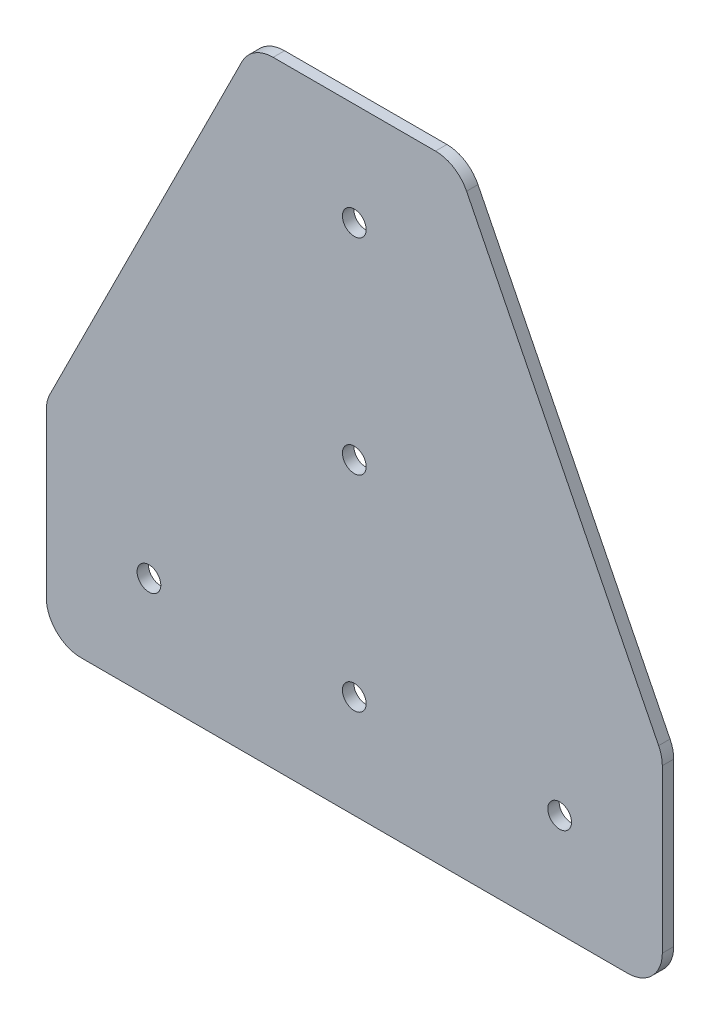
ISO-10303-21;
HEADER;
FILE_DESCRIPTION(('STEP AP214'),'2;1');
FILE_NAME('part.step','',(''),(''),'','','');
FILE_SCHEMA(('AUTOMOTIVE_DESIGN { 1 0 10303 214 1 1 1 1 }'));
ENDSEC;
DATA;
#1=APPLICATION_CONTEXT('core data for automotive mechanical design processes');
#2=APPLICATION_PROTOCOL_DEFINITION('international standard','automotive_design',2000,#1);
#3=PRODUCT_CONTEXT('',#1,'mechanical');
#4=PRODUCT('Part','Part','',(#3));
#5=PRODUCT_RELATED_PRODUCT_CATEGORY('part','',(#4));
#6=PRODUCT_DEFINITION_FORMATION('','',#4);
#7=PRODUCT_DEFINITION_CONTEXT('part definition',#1,'design');
#8=PRODUCT_DEFINITION('design','',#6,#7);
#9=PRODUCT_DEFINITION_SHAPE('','',#8);
#10=(LENGTH_UNIT() NAMED_UNIT(*) SI_UNIT(.MILLI.,.METRE.));
#11=(NAMED_UNIT(*) PLANE_ANGLE_UNIT() SI_UNIT($,.RADIAN.));
#12=(NAMED_UNIT(*) SI_UNIT($,.STERADIAN.) SOLID_ANGLE_UNIT());
#13=UNCERTAINTY_MEASURE_WITH_UNIT(LENGTH_MEASURE(1.E-05),#10,'distance_accuracy_value','');
#14=(GEOMETRIC_REPRESENTATION_CONTEXT(3) GLOBAL_UNCERTAINTY_ASSIGNED_CONTEXT((#13)) GLOBAL_UNIT_ASSIGNED_CONTEXT((#10,
#11,#12)) REPRESENTATION_CONTEXT('',''));
#15=CARTESIAN_POINT('',(0.,0.,0.));
#16=DIRECTION('',(0.,0.,1.));
#17=DIRECTION('',(1.,0.,0.));
#18=AXIS2_PLACEMENT_3D('',#15,#16,#17);
#19=CARTESIAN_POINT('',(-38.020625,0.,0.));
#20=DIRECTION('',(0.,1.,0.));
#21=DIRECTION('',(0.,0.,1.));
#22=AXIS2_PLACEMENT_3D('',#19,#20,#21);
#23=PLANE('',#22);
#24=DIRECTION('',(0.,0.,-1.));
#25=VECTOR('',#24,1.);
#26=CARTESIAN_POINT('',(38.0206250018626,0.,0.79375));
#27=LINE('',#26,#25);
#28=CARTESIAN_POINT('',(38.0206250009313,0.,0.));
#29=VERTEX_POINT('',#28);
#30=CARTESIAN_POINT('',(38.0206250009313,0.,1.5875));
#31=VERTEX_POINT('',#30);
#32=EDGE_CURVE('E160',#29,#31,#27,.F.);
#33=ORIENTED_EDGE('',*,*,#32,.T.);
#34=DIRECTION('',(1.,0.,0.));
#35=VECTOR('',#34,1.);
#36=CARTESIAN_POINT('',(0.,0.,1.5875));
#37=LINE('',#36,#35);
#38=CARTESIAN_POINT('',(-38.0206249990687,0.,1.5875));
#39=VERTEX_POINT('',#38);
#40=EDGE_CURVE('E194',#39,#31,#37,.T.);
#41=ORIENTED_EDGE('',*,*,#40,.F.);
#42=DIRECTION('',(0.,0.,1.));
#43=VECTOR('',#42,1.);
#44=CARTESIAN_POINT('',(-38.0206249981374,0.,0.79375));
#45=LINE('',#44,#43);
#46=CARTESIAN_POINT('',(-38.0206249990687,0.,0.));
#47=VERTEX_POINT('',#46);
#48=EDGE_CURVE('E130',#39,#47,#45,.F.);
#49=ORIENTED_EDGE('',*,*,#48,.T.);
#50=DIRECTION('',(1.,0.,0.));
#51=VECTOR('',#50,1.);
#52=CARTESIAN_POINT('',(0.,0.,0.));
#53=LINE('',#52,#51);
#54=EDGE_CURVE('E211',#47,#29,#53,.T.);
#55=ORIENTED_EDGE('',*,*,#54,.T.);
#56=EDGE_LOOP('',(#33,#41,#49,#55));
#57=FACE_BOUND('',#56,.T.);
#58=ADVANCED_FACE('F16',(#57),#23,.F.);
#59=CARTESIAN_POINT('',(38.020625,4.841875,1.5875));
#60=DIRECTION('',(0.,0.,-1.));
#61=DIRECTION('',(0.,1.,0.));
#62=AXIS2_PLACEMENT_3D('',#59,#60,#61);
#63=CYLINDRICAL_SURFACE('',#62,4.841875);
#64=ORIENTED_EDGE('',*,*,#32,.F.);
#65=CARTESIAN_POINT('',(38.020625,4.841875,0.));
#66=DIRECTION('',(0.,0.,-1.));
#67=DIRECTION('',(0.,1.,0.));
#68=AXIS2_PLACEMENT_3D('',#65,#66,#67);
#69=CIRCLE('',#68,4.841875);
#70=CARTESIAN_POINT('',(42.8625,4.841875,0.));
#71=VERTEX_POINT('',#70);
#72=EDGE_CURVE('E208',#29,#71,#69,.F.);
#73=ORIENTED_EDGE('',*,*,#72,.T.);
#74=DIRECTION('',(0.,0.,1.));
#75=VECTOR('',#74,1.);
#76=CARTESIAN_POINT('',(42.8625,4.841875,0.79375));
#77=LINE('',#76,#75);
#78=CARTESIAN_POINT('',(42.8625,4.841875,1.5875));
#79=VERTEX_POINT('',#78);
#80=EDGE_CURVE('E157',#71,#79,#77,.T.);
#81=ORIENTED_EDGE('',*,*,#80,.T.);
#82=CARTESIAN_POINT('',(38.020625,4.841875,1.5875));
#83=DIRECTION('',(0.,0.,-1.));
#84=DIRECTION('',(0.,1.,0.));
#85=AXIS2_PLACEMENT_3D('',#82,#83,#84);
#86=CIRCLE('',#85,4.841875);
#87=EDGE_CURVE('E192',#31,#79,#86,.F.);
#88=ORIENTED_EDGE('',*,*,#87,.F.);
#89=EDGE_LOOP('',(#64,#73,#81,#88));
#90=FACE_BOUND('',#89,.T.);
#91=ADVANCED_FACE('F301',(#90),#63,.T.);
#92=CARTESIAN_POINT('',(42.8625,4.841875,0.));
#93=DIRECTION('',(-1.,0.,0.));
#94=DIRECTION('',(0.,0.,1.));
#95=AXIS2_PLACEMENT_3D('',#92,#93,#94);
#96=PLANE('',#95);
#97=ORIENTED_EDGE('',*,*,#80,.F.);
#98=DIRECTION('',(0.,1.,0.));
#99=VECTOR('',#98,1.);
#100=CARTESIAN_POINT('',(42.8625,42.8625,0.));
#101=LINE('',#100,#99);
#102=CARTESIAN_POINT('',(42.8625,27.4319883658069,0.));
#103=VERTEX_POINT('',#102);
#104=EDGE_CURVE('E207',#71,#103,#101,.T.);
#105=ORIENTED_EDGE('',*,*,#104,.T.);
#106=DIRECTION('',(0.,0.,-1.));
#107=VECTOR('',#106,1.);
#108=CARTESIAN_POINT('',(42.8625,27.4319883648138,0.79375));
#109=LINE('',#108,#107);
#110=CARTESIAN_POINT('',(42.8625,27.4319883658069,1.5875));
#111=VERTEX_POINT('',#110);
#112=EDGE_CURVE('E104',#103,#111,#109,.F.);
#113=ORIENTED_EDGE('',*,*,#112,.T.);
#114=DIRECTION('',(0.,1.,0.));
#115=VECTOR('',#114,1.);
#116=CARTESIAN_POINT('',(42.8625,42.8625,1.5875));
#117=LINE('',#116,#115);
#118=EDGE_CURVE('E191',#79,#111,#117,.T.);
#119=ORIENTED_EDGE('',*,*,#118,.F.);
#120=EDGE_LOOP('',(#97,#105,#113,#119));
#121=FACE_BOUND('',#120,.T.);
#122=ADVANCED_FACE('F300',(#121),#96,.F.);
#123=CARTESIAN_POINT('',(38.020625,27.4319883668,1.5875));
#124=DIRECTION('',(0.,0.,-1.));
#125=DIRECTION('',(0.,1.,0.));
#126=AXIS2_PLACEMENT_3D('',#123,#124,#125);
#127=CYLINDRICAL_SURFACE('',#126,4.841875);
#128=ORIENTED_EDGE('',*,*,#112,.F.);
#129=CARTESIAN_POINT('',(38.020625,27.4319883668,0.));
#130=DIRECTION('',(0.,0.,-1.));
#131=DIRECTION('',(0.,1.,0.));
#132=AXIS2_PLACEMENT_3D('',#129,#130,#131);
#133=CIRCLE('',#132,4.841875);
#134=CARTESIAN_POINT('',(42.3513296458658,29.5973406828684,0.));
#135=VERTEX_POINT('',#134);
#136=EDGE_CURVE('E20',#103,#135,#133,.F.);
#137=ORIENTED_EDGE('',*,*,#136,.T.);
#138=DIRECTION('',(0.,0.,1.));
#139=VECTOR('',#138,1.);
#140=CARTESIAN_POINT('',(42.3513296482,29.5973406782,0.79375));
#141=LINE('',#140,#139);
#142=CARTESIAN_POINT('',(42.351329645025,29.5973406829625,1.5875));
#143=VERTEX_POINT('',#142);
#144=EDGE_CURVE('E111',#135,#143,#141,.T.);
#145=ORIENTED_EDGE('',*,*,#144,.T.);
#146=CARTESIAN_POINT('',(38.020625,27.4319883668,1.5875));
#147=DIRECTION('',(0.,0.,-1.));
#148=DIRECTION('',(0.,1.,0.));
#149=AXIS2_PLACEMENT_3D('',#146,#147,#148);
#150=CIRCLE('',#149,4.841875);
#151=EDGE_CURVE('E189',#111,#143,#150,.F.);
#152=ORIENTED_EDGE('',*,*,#151,.F.);
#153=EDGE_LOOP('',(#128,#137,#145,#152));
#154=FACE_BOUND('',#153,.T.);
#155=ADVANCED_FACE('F128',(#154),#127,.T.);
#156=CARTESIAN_POINT('',(15.6257613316,83.0484773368,0.));
#157=DIRECTION('',(-0.894427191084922,-0.447213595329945,0.));
#158=DIRECTION('',(0.447213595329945,-0.894427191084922,0.));
#159=AXIS2_PLACEMENT_3D('',#156,#157,#158);
#160=PLANE('',#159);
#161=ORIENTED_EDGE('',*,*,#144,.F.);
#162=DIRECTION('',(0.447213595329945,-0.894427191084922,0.));
#163=VECTOR('',#162,1.);
#164=CARTESIAN_POINT('',(15.6257613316,83.0484773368,0.));
#165=LINE('',#164,#163);
#166=CARTESIAN_POINT('',(15.6257613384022,83.0484773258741,0.));
#167=VERTEX_POINT('',#166);
#168=EDGE_CURVE('E115',#135,#167,#165,.F.);
#169=ORIENTED_EDGE('',*,*,#168,.T.);
#170=DIRECTION('',(0.,0.,-1.));
#171=VECTOR('',#170,1.);
#172=CARTESIAN_POINT('',(15.6257613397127,83.0484773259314,0.79375));
#173=LINE('',#172,#171);
#174=CARTESIAN_POINT('',(15.6257613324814,83.0484773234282,1.5875));
#175=VERTEX_POINT('',#174);
#176=EDGE_CURVE('E117',#167,#175,#173,.F.);
#177=ORIENTED_EDGE('',*,*,#176,.T.);
#178=DIRECTION('',(-0.447213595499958,0.894427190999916,0.));
#179=VECTOR('',#178,1.);
#180=CARTESIAN_POINT('',(42.351329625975,29.597340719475,1.5875));
#181=LINE('',#180,#179);
#182=EDGE_CURVE('E116',#143,#175,#181,.T.);
#183=ORIENTED_EDGE('',*,*,#182,.F.);
#184=EDGE_LOOP('',(#161,#169,#177,#183));
#185=FACE_BOUND('',#184,.T.);
#186=ADVANCED_FACE('F113',(#185),#160,.F.);
#187=CARTESIAN_POINT('',(11.2950566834,80.883125,1.5875));
#188=DIRECTION('',(0.,0.,-1.));
#189=DIRECTION('',(0.,1.,0.));
#190=AXIS2_PLACEMENT_3D('',#187,#188,#189);
#191=CYLINDRICAL_SURFACE('',#190,4.841875);
#192=ORIENTED_EDGE('',*,*,#176,.F.);
#193=CARTESIAN_POINT('',(11.2950566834,80.883125,0.));
#194=DIRECTION('',(0.,0.,-1.));
#195=DIRECTION('',(0.,1.,0.));
#196=AXIS2_PLACEMENT_3D('',#193,#194,#195);
#197=CIRCLE('',#196,4.841875);
#198=CARTESIAN_POINT('',(11.2950566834,85.725,0.));
#199=VERTEX_POINT('',#198);
#200=EDGE_CURVE('E127',#167,#199,#197,.F.);
#201=ORIENTED_EDGE('',*,*,#200,.T.);
#202=DIRECTION('',(0.,0.,1.));
#203=VECTOR('',#202,1.);
#204=CARTESIAN_POINT('',(11.2950566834,85.725,0.79375));
#205=LINE('',#204,#203);
#206=CARTESIAN_POINT('',(11.2950566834,85.725,1.5875));
#207=VERTEX_POINT('',#206);
#208=EDGE_CURVE('E152',#199,#207,#205,.T.);
#209=ORIENTED_EDGE('',*,*,#208,.T.);
#210=CARTESIAN_POINT('',(11.2950566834,80.883125,1.5875));
#211=DIRECTION('',(0.,0.,-1.));
#212=DIRECTION('',(0.,1.,0.));
#213=AXIS2_PLACEMENT_3D('',#210,#211,#212);
#214=CIRCLE('',#213,4.841875);
#215=EDGE_CURVE('E186',#175,#207,#214,.F.);
#216=ORIENTED_EDGE('',*,*,#215,.F.);
#217=EDGE_LOOP('',(#192,#201,#209,#216));
#218=FACE_BOUND('',#217,.T.);
#219=ADVANCED_FACE('F295',(#218),#191,.T.);
#220=CARTESIAN_POINT('',(-11.2950566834,85.725,1.5875));
#221=DIRECTION('',(0.,-1.,0.));
#222=DIRECTION('',(0.,0.,-1.));
#223=AXIS2_PLACEMENT_3D('',#220,#221,#222);
#224=PLANE('',#223);
#225=ORIENTED_EDGE('',*,*,#208,.F.);
#226=DIRECTION('',(-1.,0.,0.));
#227=VECTOR('',#226,1.);
#228=CARTESIAN_POINT('',(0.,85.725,0.));
#229=LINE('',#228,#227);
#230=CARTESIAN_POINT('',(-11.2950566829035,85.725,0.));
#231=VERTEX_POINT('',#230);
#232=EDGE_CURVE('E138',#199,#231,#229,.T.);
#233=ORIENTED_EDGE('',*,*,#232,.T.);
#234=DIRECTION('',(0.,0.,-1.));
#235=VECTOR('',#234,1.);
#236=CARTESIAN_POINT('',(-11.2950566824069,85.725,0.79375));
#237=LINE('',#236,#235);
#238=CARTESIAN_POINT('',(-11.2950566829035,85.725,1.5875));
#239=VERTEX_POINT('',#238);
#240=EDGE_CURVE('E149',#231,#239,#237,.F.);
#241=ORIENTED_EDGE('',*,*,#240,.T.);
#242=DIRECTION('',(-1.,0.,0.));
#243=VECTOR('',#242,1.);
#244=CARTESIAN_POINT('',(0.,85.725,1.5875));
#245=LINE('',#244,#243);
#246=EDGE_CURVE('E185',#207,#239,#245,.T.);
#247=ORIENTED_EDGE('',*,*,#246,.F.);
#248=EDGE_LOOP('',(#225,#233,#241,#247));
#249=FACE_BOUND('',#248,.T.);
#250=ADVANCED_FACE('F228',(#249),#224,.F.);
#251=CARTESIAN_POINT('',(-11.2950566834,80.883125,1.5875));
#252=DIRECTION('',(0.,0.,-1.));
#253=DIRECTION('',(0.,1.,0.));
#254=AXIS2_PLACEMENT_3D('',#251,#252,#253);
#255=CYLINDRICAL_SURFACE('',#254,4.841875);
#256=ORIENTED_EDGE('',*,*,#240,.F.);
#257=CARTESIAN_POINT('',(-11.2950566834,80.883125,0.));
#258=DIRECTION('',(0.,0.,-1.));
#259=DIRECTION('',(0.,1.,0.));
#260=AXIS2_PLACEMENT_3D('',#257,#258,#259);
#261=CIRCLE('',#260,4.841875);
#262=CARTESIAN_POINT('',(-15.6257613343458,83.0484773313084,0.));
#263=VERTEX_POINT('',#262);
#264=EDGE_CURVE('E222',#231,#263,#261,.F.);
#265=ORIENTED_EDGE('',*,*,#264,.T.);
#266=DIRECTION('',(0.,0.,1.));
#267=VECTOR('',#266,1.);
#268=CARTESIAN_POINT('',(-15.6257613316,83.0484773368,0.79375));
#269=LINE('',#268,#267);
#270=CARTESIAN_POINT('',(-15.625761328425,83.0484773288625,1.5875));
#271=VERTEX_POINT('',#270);
#272=EDGE_CURVE('E146',#263,#271,#269,.T.);
#273=ORIENTED_EDGE('',*,*,#272,.T.);
#274=CARTESIAN_POINT('',(-11.2950566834,80.883125,1.5875));
#275=DIRECTION('',(0.,0.,-1.));
#276=DIRECTION('',(0.,1.,0.));
#277=AXIS2_PLACEMENT_3D('',#274,#275,#276);
#278=CIRCLE('',#277,4.841875);
#279=EDGE_CURVE('E183',#239,#271,#278,.F.);
#280=ORIENTED_EDGE('',*,*,#279,.F.);
#281=EDGE_LOOP('',(#256,#265,#273,#280));
#282=FACE_BOUND('',#281,.T.);
#283=ADVANCED_FACE('F235',(#282),#255,.T.);
#284=CARTESIAN_POINT('',(-42.3513296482,29.5973406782,0.));
#285=DIRECTION('',(0.894427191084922,-0.447213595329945,0.));
#286=DIRECTION('',(0.447213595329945,0.894427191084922,0.));
#287=AXIS2_PLACEMENT_3D('',#284,#285,#286);
#288=PLANE('',#287);
#289=ORIENTED_EDGE('',*,*,#272,.F.);
#290=DIRECTION('',(0.447213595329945,0.894427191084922,0.));
#291=VECTOR('',#290,1.);
#292=CARTESIAN_POINT('',(-42.3513296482,29.5973406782,0.));
#293=LINE('',#292,#291);
#294=CARTESIAN_POINT('',(-42.351329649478,29.5973406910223,0.));
#295=VERTEX_POINT('',#294);
#296=EDGE_CURVE('E219',#263,#295,#293,.F.);
#297=ORIENTED_EDGE('',*,*,#296,.T.);
#298=DIRECTION('',(0.,0.,-1.));
#299=VECTOR('',#298,1.);
#300=CARTESIAN_POINT('',(-42.3513296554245,29.5973406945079,0.79375));
#301=LINE('',#300,#299);
#302=CARTESIAN_POINT('',(-42.3513296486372,29.5973406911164,1.5875));
#303=VERTEX_POINT('',#302);
#304=EDGE_CURVE('E143',#295,#303,#301,.F.);
#305=ORIENTED_EDGE('',*,*,#304,.T.);
#306=DIRECTION('',(-0.447213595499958,-0.894427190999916,0.));
#307=VECTOR('',#306,1.);
#308=CARTESIAN_POINT('',(-15.6257613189,83.048477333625,1.5875));
#309=LINE('',#308,#307);
#310=EDGE_CURVE('E181',#271,#303,#309,.T.);
#311=ORIENTED_EDGE('',*,*,#310,.F.);
#312=EDGE_LOOP('',(#289,#297,#305,#311));
#313=FACE_BOUND('',#312,.T.);
#314=ADVANCED_FACE('F253',(#313),#288,.F.);
#315=CARTESIAN_POINT('',(-38.020625,27.4319883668,1.5875));
#316=DIRECTION('',(0.,0.,-1.));
#317=DIRECTION('',(0.,1.,0.));
#318=AXIS2_PLACEMENT_3D('',#315,#316,#317);
#319=CYLINDRICAL_SURFACE('',#318,4.841875);
#320=ORIENTED_EDGE('',*,*,#304,.F.);
#321=CARTESIAN_POINT('',(-38.020625,27.4319883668,0.));
#322=DIRECTION('',(0.,0.,-1.));
#323=DIRECTION('',(0.,1.,0.));
#324=AXIS2_PLACEMENT_3D('',#321,#322,#323);
#325=CIRCLE('',#324,4.841875);
#326=CARTESIAN_POINT('',(-42.8625,27.4319883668,0.));
#327=VERTEX_POINT('',#326);
#328=EDGE_CURVE('E216',#295,#327,#325,.F.);
#329=ORIENTED_EDGE('',*,*,#328,.T.);
#330=DIRECTION('',(0.,0.,1.));
#331=VECTOR('',#330,1.);
#332=CARTESIAN_POINT('',(-42.8625,27.4319883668,0.79375));
#333=LINE('',#332,#331);
#334=CARTESIAN_POINT('',(-42.8625,27.4319883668,1.5875));
#335=VERTEX_POINT('',#334);
#336=EDGE_CURVE('E135',#327,#335,#333,.T.);
#337=ORIENTED_EDGE('',*,*,#336,.T.);
#338=CARTESIAN_POINT('',(-38.020625,27.4319883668,1.5875));
#339=DIRECTION('',(0.,0.,-1.));
#340=DIRECTION('',(0.,1.,0.));
#341=AXIS2_PLACEMENT_3D('',#338,#339,#340);
#342=CIRCLE('',#341,4.841875);
#343=EDGE_CURVE('E179',#303,#335,#342,.F.);
#344=ORIENTED_EDGE('',*,*,#343,.F.);
#345=EDGE_LOOP('',(#320,#329,#337,#344));
#346=FACE_BOUND('',#345,.T.);
#347=ADVANCED_FACE('F250',(#346),#319,.T.);
#348=CARTESIAN_POINT('',(-42.8625,4.841875,1.5875));
#349=DIRECTION('',(1.,0.,0.));
#350=DIRECTION('',(0.,0.,-1.));
#351=AXIS2_PLACEMENT_3D('',#348,#349,#350);
#352=PLANE('',#351);
#353=DIRECTION('',(0.,0.,-1.));
#354=VECTOR('',#353,1.);
#355=CARTESIAN_POINT('',(-42.8625,4.84187499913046,0.79375));
#356=LINE('',#355,#354);
#357=CARTESIAN_POINT('',(-42.8625,4.84187499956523,0.));
#358=VERTEX_POINT('',#357);
#359=CARTESIAN_POINT('',(-42.8625,4.84187499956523,1.5875));
#360=VERTEX_POINT('',#359);
#361=EDGE_CURVE('E129',#358,#360,#356,.F.);
#362=ORIENTED_EDGE('',*,*,#361,.T.);
#363=DIRECTION('',(0.,-1.,0.));
#364=VECTOR('',#363,1.);
#365=CARTESIAN_POINT('',(-42.8625,42.8625,1.5875));
#366=LINE('',#365,#364);
#367=EDGE_CURVE('E35',#335,#360,#366,.T.);
#368=ORIENTED_EDGE('',*,*,#367,.F.);
#369=ORIENTED_EDGE('',*,*,#336,.F.);
#370=DIRECTION('',(0.,-1.,0.));
#371=VECTOR('',#370,1.);
#372=CARTESIAN_POINT('',(-42.8625,42.8625,0.));
#373=LINE('',#372,#371);
#374=EDGE_CURVE('E215',#327,#358,#373,.T.);
#375=ORIENTED_EDGE('',*,*,#374,.T.);
#376=EDGE_LOOP('',(#362,#368,#369,#375));
#377=FACE_BOUND('',#376,.T.);
#378=ADVANCED_FACE('F246',(#377),#352,.F.);
#379=CARTESIAN_POINT('',(-38.020625,4.841875,1.5875));
#380=DIRECTION('',(0.,0.,-1.));
#381=DIRECTION('',(0.,1.,0.));
#382=AXIS2_PLACEMENT_3D('',#379,#380,#381);
#383=CYLINDRICAL_SURFACE('',#382,4.841875);
#384=ORIENTED_EDGE('',*,*,#361,.F.);
#385=CARTESIAN_POINT('',(-38.020625,4.841875,0.));
#386=DIRECTION('',(0.,0.,-1.));
#387=DIRECTION('',(0.,1.,0.));
#388=AXIS2_PLACEMENT_3D('',#385,#386,#387);
#389=CIRCLE('',#388,4.841875);
#390=EDGE_CURVE('E212',#358,#47,#389,.F.);
#391=ORIENTED_EDGE('',*,*,#390,.T.);
#392=ORIENTED_EDGE('',*,*,#48,.F.);
#393=CARTESIAN_POINT('',(-38.020625,4.841875,1.5875));
#394=DIRECTION('',(0.,0.,-1.));
#395=DIRECTION('',(0.,1.,0.));
#396=AXIS2_PLACEMENT_3D('',#393,#394,#395);
#397=CIRCLE('',#396,4.841875);
#398=EDGE_CURVE('E177',#360,#39,#397,.F.);
#399=ORIENTED_EDGE('',*,*,#398,.F.);
#400=EDGE_LOOP('',(#384,#391,#392,#399));
#401=FACE_BOUND('',#400,.T.);
#402=ADVANCED_FACE('F290',(#401),#383,.T.);
#403=CARTESIAN_POINT('',(-28.575,14.2875,0.));
#404=DIRECTION('',(0.,0.,1.));
#405=DIRECTION('',(1.,0.,0.));
#406=AXIS2_PLACEMENT_3D('',#403,#404,#405);
#407=CYLINDRICAL_SURFACE('',#406,1.651);
#408=CARTESIAN_POINT('',(-28.575,14.2875,1.5875));
#409=DIRECTION('',(0.,0.,1.));
#410=DIRECTION('',(1.,0.,0.));
#411=AXIS2_PLACEMENT_3D('',#408,#409,#410);
#412=CIRCLE('',#411,1.651);
#413=CARTESIAN_POINT('',(-26.924,14.2875,1.5875));
#414=VERTEX_POINT('',#413);
#415=EDGE_CURVE('E174',#414,#414,#412,.F.);
#416=ORIENTED_EDGE('',*,*,#415,.F.);
#417=EDGE_LOOP('',(#416));
#418=FACE_BOUND('',#417,.T.);
#419=CARTESIAN_POINT('',(-28.575,14.2875,0.));
#420=DIRECTION('',(0.,0.,1.));
#421=DIRECTION('',(1.,0.,0.));
#422=AXIS2_PLACEMENT_3D('',#419,#420,#421);
#423=CIRCLE('',#422,1.651);
#424=CARTESIAN_POINT('',(-26.924,14.2875,0.));
#425=VERTEX_POINT('',#424);
#426=EDGE_CURVE('E204',#425,#425,#423,.F.);
#427=ORIENTED_EDGE('',*,*,#426,.T.);
#428=EDGE_LOOP('',(#427));
#429=FACE_BOUND('',#428,.T.);
#430=ADVANCED_FACE('F286',(#418,#429),#407,.F.);
#431=CARTESIAN_POINT('',(28.575,14.2875,0.));
#432=DIRECTION('',(0.,0.,1.));
#433=DIRECTION('',(1.,0.,0.));
#434=AXIS2_PLACEMENT_3D('',#431,#432,#433);
#435=CYLINDRICAL_SURFACE('',#434,1.651);
#436=CARTESIAN_POINT('',(28.575,14.2875,1.5875));
#437=DIRECTION('',(0.,0.,1.));
#438=DIRECTION('',(1.,0.,0.));
#439=AXIS2_PLACEMENT_3D('',#436,#437,#438);
#440=CIRCLE('',#439,1.651);
#441=CARTESIAN_POINT('',(30.226,14.2875,1.5875));
#442=VERTEX_POINT('',#441);
#443=EDGE_CURVE('E171',#442,#442,#440,.F.);
#444=ORIENTED_EDGE('',*,*,#443,.F.);
#445=EDGE_LOOP('',(#444));
#446=FACE_BOUND('',#445,.T.);
#447=CARTESIAN_POINT('',(28.575,14.2875,0.));
#448=DIRECTION('',(0.,0.,1.));
#449=DIRECTION('',(1.,0.,0.));
#450=AXIS2_PLACEMENT_3D('',#447,#448,#449);
#451=CIRCLE('',#450,1.651);
#452=CARTESIAN_POINT('',(30.226,14.2875,0.));
#453=VERTEX_POINT('',#452);
#454=EDGE_CURVE('E201',#453,#453,#451,.F.);
#455=ORIENTED_EDGE('',*,*,#454,.T.);
#456=EDGE_LOOP('',(#455));
#457=FACE_BOUND('',#456,.T.);
#458=ADVANCED_FACE('F282',(#446,#457),#435,.F.);
#459=CARTESIAN_POINT('',(0.,14.2875,0.));
#460=DIRECTION('',(0.,0.,1.));
#461=DIRECTION('',(1.,0.,0.));
#462=AXIS2_PLACEMENT_3D('',#459,#460,#461);
#463=CYLINDRICAL_SURFACE('',#462,1.651);
#464=CARTESIAN_POINT('',(0.,14.2875,1.5875));
#465=DIRECTION('',(0.,0.,1.));
#466=DIRECTION('',(1.,0.,0.));
#467=AXIS2_PLACEMENT_3D('',#464,#465,#466);
#468=CIRCLE('',#467,1.651);
#469=CARTESIAN_POINT('',(1.651,14.2875,1.5875));
#470=VERTEX_POINT('',#469);
#471=EDGE_CURVE('E168',#470,#470,#468,.F.);
#472=ORIENTED_EDGE('',*,*,#471,.F.);
#473=EDGE_LOOP('',(#472));
#474=FACE_BOUND('',#473,.T.);
#475=CARTESIAN_POINT('',(0.,14.2875,0.));
#476=DIRECTION('',(0.,0.,1.));
#477=DIRECTION('',(1.,0.,0.));
#478=AXIS2_PLACEMENT_3D('',#475,#476,#477);
#479=CIRCLE('',#478,1.651);
#480=CARTESIAN_POINT('',(1.651,14.2875,0.));
#481=VERTEX_POINT('',#480);
#482=EDGE_CURVE('E198',#481,#481,#479,.F.);
#483=ORIENTED_EDGE('',*,*,#482,.T.);
#484=EDGE_LOOP('',(#483));
#485=FACE_BOUND('',#484,.T.);
#486=ADVANCED_FACE('F278',(#474,#485),#463,.F.);
#487=CARTESIAN_POINT('',(0.,71.4375,0.));
#488=DIRECTION('',(0.,0.,1.));
#489=DIRECTION('',(1.,0.,0.));
#490=AXIS2_PLACEMENT_3D('',#487,#488,#489);
#491=CYLINDRICAL_SURFACE('',#490,1.651);
#492=CARTESIAN_POINT('',(0.,71.4375,1.5875));
#493=DIRECTION('',(0.,0.,1.));
#494=DIRECTION('',(1.,0.,0.));
#495=AXIS2_PLACEMENT_3D('',#492,#493,#494);
#496=CIRCLE('',#495,1.651);
#497=CARTESIAN_POINT('',(1.651,71.4375,1.5875));
#498=VERTEX_POINT('',#497);
#499=EDGE_CURVE('E165',#498,#498,#496,.F.);
#500=ORIENTED_EDGE('',*,*,#499,.F.);
#501=EDGE_LOOP('',(#500));
#502=FACE_BOUND('',#501,.T.);
#503=CARTESIAN_POINT('',(0.,71.4375,0.));
#504=DIRECTION('',(0.,0.,1.));
#505=DIRECTION('',(1.,0.,0.));
#506=AXIS2_PLACEMENT_3D('',#503,#504,#505);
#507=CIRCLE('',#506,1.651);
#508=CARTESIAN_POINT('',(1.651,71.4375,0.));
#509=VERTEX_POINT('',#508);
#510=EDGE_CURVE('E195',#509,#509,#507,.F.);
#511=ORIENTED_EDGE('',*,*,#510,.T.);
#512=EDGE_LOOP('',(#511));
#513=FACE_BOUND('',#512,.T.);
#514=ADVANCED_FACE('F275',(#502,#513),#491,.F.);
#515=CARTESIAN_POINT('',(-42.8625,0.,0.));
#516=DIRECTION('',(0.,0.,1.));
#517=DIRECTION('',(1.,0.,0.));
#518=AXIS2_PLACEMENT_3D('',#515,#516,#517);
#519=PLANE('',#518);
#520=ORIENTED_EDGE('',*,*,#510,.F.);
#521=EDGE_LOOP('',(#520));
#522=FACE_BOUND('',#521,.T.);
#523=ORIENTED_EDGE('',*,*,#482,.F.);
#524=EDGE_LOOP('',(#523));
#525=FACE_BOUND('',#524,.T.);
#526=ORIENTED_EDGE('',*,*,#454,.F.);
#527=EDGE_LOOP('',(#526));
#528=FACE_BOUND('',#527,.T.);
#529=ORIENTED_EDGE('',*,*,#426,.F.);
#530=EDGE_LOOP('',(#529));
#531=FACE_BOUND('',#530,.T.);
#532=CARTESIAN_POINT('',(0.,42.8625,0.));
#533=DIRECTION('',(0.,0.,1.));
#534=DIRECTION('',(1.,0.,0.));
#535=AXIS2_PLACEMENT_3D('',#532,#533,#534);
#536=CIRCLE('',#535,1.651);
#537=CARTESIAN_POINT('',(1.651,42.8625,0.));
#538=VERTEX_POINT('',#537);
#539=EDGE_CURVE('E26',#538,#538,#536,.F.);
#540=ORIENTED_EDGE('',*,*,#539,.F.);
#541=EDGE_LOOP('',(#540));
#542=FACE_BOUND('',#541,.T.);
#543=ORIENTED_EDGE('',*,*,#72,.F.);
#544=ORIENTED_EDGE('',*,*,#54,.F.);
#545=ORIENTED_EDGE('',*,*,#390,.F.);
#546=ORIENTED_EDGE('',*,*,#374,.F.);
#547=ORIENTED_EDGE('',*,*,#328,.F.);
#548=ORIENTED_EDGE('',*,*,#296,.F.);
#549=ORIENTED_EDGE('',*,*,#264,.F.);
#550=ORIENTED_EDGE('',*,*,#232,.F.);
#551=ORIENTED_EDGE('',*,*,#200,.F.);
#552=ORIENTED_EDGE('',*,*,#168,.F.);
#553=ORIENTED_EDGE('',*,*,#136,.F.);
#554=ORIENTED_EDGE('',*,*,#104,.F.);
#555=EDGE_LOOP('',(#543,#544,#545,#546,#547,#548,#549,#550,#551,#552,#553,#554));
#556=FACE_BOUND('',#555,.T.);
#557=ADVANCED_FACE('F122',(#522,#525,#528,#531,#542,#556),#519,.F.);
#558=CARTESIAN_POINT('',(-42.8625,0.,1.5875));
#559=DIRECTION('',(0.,0.,1.));
#560=DIRECTION('',(1.,0.,0.));
#561=AXIS2_PLACEMENT_3D('',#558,#559,#560);
#562=PLANE('',#561);
#563=ORIENTED_EDGE('',*,*,#499,.T.);
#564=EDGE_LOOP('',(#563));
#565=FACE_BOUND('',#564,.T.);
#566=ORIENTED_EDGE('',*,*,#471,.T.);
#567=EDGE_LOOP('',(#566));
#568=FACE_BOUND('',#567,.T.);
#569=ORIENTED_EDGE('',*,*,#443,.T.);
#570=EDGE_LOOP('',(#569));
#571=FACE_BOUND('',#570,.T.);
#572=ORIENTED_EDGE('',*,*,#415,.T.);
#573=EDGE_LOOP('',(#572));
#574=FACE_BOUND('',#573,.T.);
#575=CARTESIAN_POINT('',(0.,42.8625,1.5875));
#576=DIRECTION('',(0.,0.,1.));
#577=DIRECTION('',(1.,0.,0.));
#578=AXIS2_PLACEMENT_3D('',#575,#576,#577);
#579=CIRCLE('',#578,1.651);
#580=CARTESIAN_POINT('',(1.651,42.8625,1.5875));
#581=VERTEX_POINT('',#580);
#582=EDGE_CURVE('E10',#581,#581,#579,.T.);
#583=ORIENTED_EDGE('',*,*,#582,.F.);
#584=EDGE_LOOP('',(#583));
#585=FACE_BOUND('',#584,.T.);
#586=ORIENTED_EDGE('',*,*,#367,.T.);
#587=ORIENTED_EDGE('',*,*,#398,.T.);
#588=ORIENTED_EDGE('',*,*,#40,.T.);
#589=ORIENTED_EDGE('',*,*,#87,.T.);
#590=ORIENTED_EDGE('',*,*,#118,.T.);
#591=ORIENTED_EDGE('',*,*,#151,.T.);
#592=ORIENTED_EDGE('',*,*,#182,.T.);
#593=ORIENTED_EDGE('',*,*,#215,.T.);
#594=ORIENTED_EDGE('',*,*,#246,.T.);
#595=ORIENTED_EDGE('',*,*,#279,.T.);
#596=ORIENTED_EDGE('',*,*,#310,.T.);
#597=ORIENTED_EDGE('',*,*,#343,.T.);
#598=EDGE_LOOP('',(#586,#587,#588,#589,#590,#591,#592,#593,#594,#595,#596,#597));
#599=FACE_BOUND('',#598,.T.);
#600=ADVANCED_FACE('F18',(#565,#568,#571,#574,#585,#599),#562,.T.);
#601=CARTESIAN_POINT('',(0.,42.8625,0.));
#602=DIRECTION('',(0.,0.,1.));
#603=DIRECTION('',(1.,0.,0.));
#604=AXIS2_PLACEMENT_3D('',#601,#602,#603);
#605=CYLINDRICAL_SURFACE('',#604,1.651);
#606=ORIENTED_EDGE('',*,*,#539,.T.);
#607=EDGE_LOOP('',(#606));
#608=FACE_BOUND('',#607,.T.);
#609=ORIENTED_EDGE('',*,*,#582,.T.);
#610=EDGE_LOOP('',(#609));
#611=FACE_BOUND('',#610,.T.);
#612=ADVANCED_FACE('F265',(#608,#611),#605,.F.);
#613=CLOSED_SHELL('',(#58,#91,#122,#155,#186,#219,#250,#283,#314,#347,#378,#402,#430,#458,#486,
#514,#557,#600,#612));
#614=MANIFOLD_SOLID_BREP('B1',#613);
#615=ADVANCED_BREP_SHAPE_REPRESENTATION('',(#18,#614),#14);
#616=SHAPE_DEFINITION_REPRESENTATION(#9,#615);
ENDSEC;
END-ISO-10303-21;
